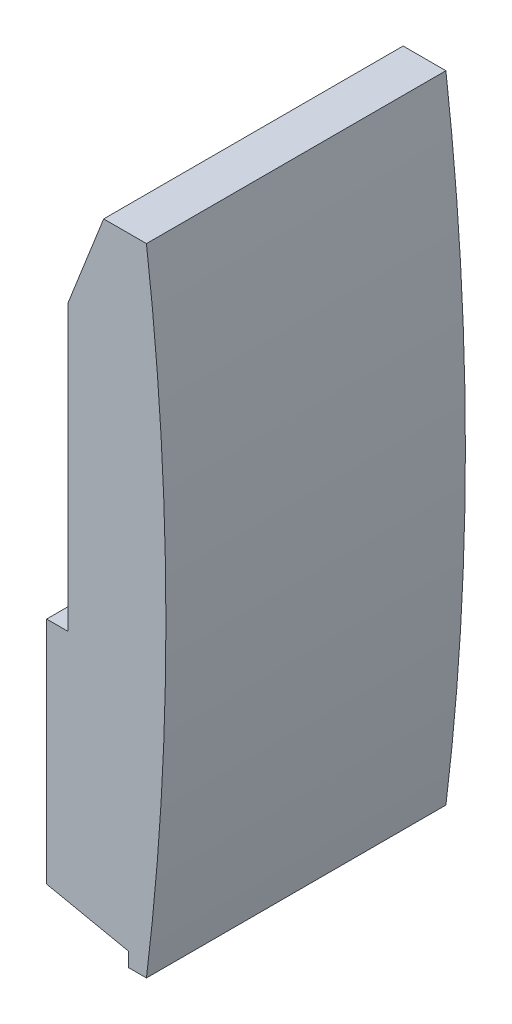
from build123d import *

# Parameters (mm, degrees)
BOSS_EXTRU_1_DEPTH = 21


with BuildPart() as part:
    # Esquisse1 → Boss.-Extru.1 (new, symmetric)
    with BuildSketch(Plane.XY):
        with BuildLine():
            Line((349, -40.2), (360.5, -42.6))
            Line((360.5, -42.6), (360.5, -44.6))
            Line((360.5, -44.6), (363, -44.6))
            ThreePointArc((363, -44.6), (365.72962691, 0), (363, 44.6))
            Line((363, 44.6), (357, 44.6))
            Line((357, 44.6), (352, 31.9))
            Line((352, 31.9), (352, -8))
            Line((352, -8), (349, -8))
            Line((349, -8), (349, -40.2))
        make_face()
    extrude(amount=BOSS_EXTRU_1_DEPTH, both=True)


solid = part.part
